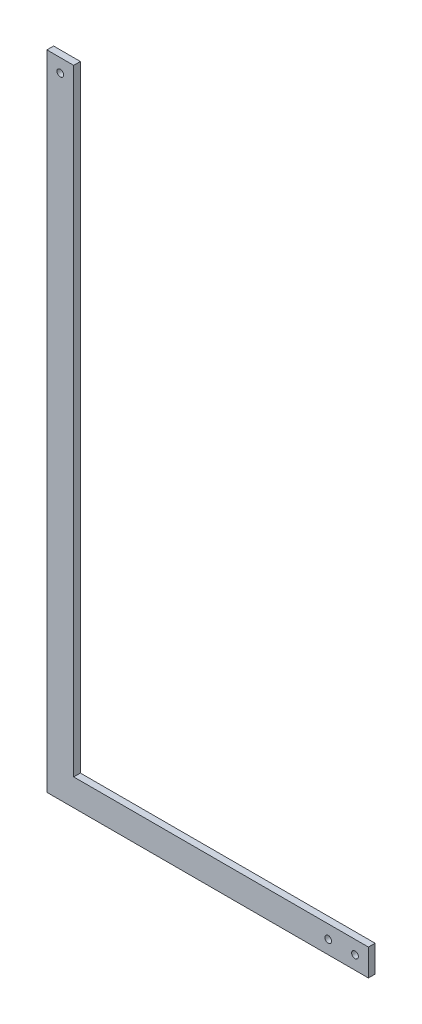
ISO-10303-21;
HEADER;
FILE_DESCRIPTION(('STEP AP214'),'2;1');
FILE_NAME('part.step','',(''),(''),'','','');
FILE_SCHEMA(('AUTOMOTIVE_DESIGN { 1 0 10303 214 1 1 1 1 }'));
ENDSEC;
DATA;
#1=APPLICATION_CONTEXT('core data for automotive mechanical design processes');
#2=APPLICATION_PROTOCOL_DEFINITION('international standard','automotive_design',2000,#1);
#3=PRODUCT_CONTEXT('',#1,'mechanical');
#4=PRODUCT('Part','Part','',(#3));
#5=PRODUCT_RELATED_PRODUCT_CATEGORY('part','',(#4));
#6=PRODUCT_DEFINITION_FORMATION('','',#4);
#7=PRODUCT_DEFINITION_CONTEXT('part definition',#1,'design');
#8=PRODUCT_DEFINITION('design','',#6,#7);
#9=PRODUCT_DEFINITION_SHAPE('','',#8);
#10=(LENGTH_UNIT() NAMED_UNIT(*) SI_UNIT(.MILLI.,.METRE.));
#11=(NAMED_UNIT(*) PLANE_ANGLE_UNIT() SI_UNIT($,.RADIAN.));
#12=(NAMED_UNIT(*) SI_UNIT($,.STERADIAN.) SOLID_ANGLE_UNIT());
#13=UNCERTAINTY_MEASURE_WITH_UNIT(LENGTH_MEASURE(1.E-05),#10,'distance_accuracy_value','');
#14=(GEOMETRIC_REPRESENTATION_CONTEXT(3) GLOBAL_UNCERTAINTY_ASSIGNED_CONTEXT((#13)) GLOBAL_UNIT_ASSIGNED_CONTEXT((#10,
#11,#12)) REPRESENTATION_CONTEXT('',''));
#15=CARTESIAN_POINT('',(0.,0.,0.));
#16=DIRECTION('',(0.,0.,1.));
#17=DIRECTION('',(1.,0.,0.));
#18=AXIS2_PLACEMENT_3D('',#15,#16,#17);
#19=CARTESIAN_POINT('',(0.,0.,3.175));
#20=DIRECTION('',(0.,0.,1.));
#21=DIRECTION('',(1.,0.,0.));
#22=AXIS2_PLACEMENT_3D('',#19,#20,#21);
#23=PLANE('',#22);
#24=CARTESIAN_POINT('',(109.199180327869,-51.9450819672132,3.175));
#25=DIRECTION('',(0.,0.,1.));
#26=DIRECTION('',(1.,0.,0.));
#27=AXIS2_PLACEMENT_3D('',#24,#25,#26);
#28=CIRCLE('',#27,1.58750000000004);
#29=CARTESIAN_POINT('',(110.786680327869,-51.9450819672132,3.175));
#30=VERTEX_POINT('',#29);
#31=EDGE_CURVE('E207',#30,#30,#28,.T.);
#32=ORIENTED_EDGE('',*,*,#31,.F.);
#33=EDGE_LOOP('',(#32));
#34=FACE_BOUND('',#33,.T.);
#35=DIRECTION('',(-1.,0.,0.));
#36=VECTOR('',#35,1.);
#37=CARTESIAN_POINT('',(-11.4508196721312,246.504918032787,3.175));
#38=LINE('',#37,#36);
#39=CARTESIAN_POINT('',(-11.4508196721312,246.504918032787,3.175));
#40=VERTEX_POINT('',#39);
#41=CARTESIAN_POINT('',(-24.1508196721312,246.504918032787,3.175));
#42=VERTEX_POINT('',#41);
#43=EDGE_CURVE('E146',#40,#42,#38,.T.);
#44=ORIENTED_EDGE('',*,*,#43,.T.);
#45=DIRECTION('',(0.,-1.,0.));
#46=VECTOR('',#45,1.);
#47=CARTESIAN_POINT('',(-24.1508196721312,246.504918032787,3.175));
#48=LINE('',#47,#46);
#49=CARTESIAN_POINT('',(-24.1508196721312,-58.2950819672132,3.175));
#50=VERTEX_POINT('',#49);
#51=EDGE_CURVE('E94',#42,#50,#48,.T.);
#52=ORIENTED_EDGE('',*,*,#51,.T.);
#53=DIRECTION('',(1.,0.,0.));
#54=VECTOR('',#53,1.);
#55=CARTESIAN_POINT('',(-24.1508196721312,-58.2950819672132,3.175));
#56=LINE('',#55,#54);
#57=CARTESIAN_POINT('',(128.249180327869,-58.2950819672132,3.175));
#58=VERTEX_POINT('',#57);
#59=EDGE_CURVE('E107',#50,#58,#56,.T.);
#60=ORIENTED_EDGE('',*,*,#59,.T.);
#61=DIRECTION('',(0.,1.,0.));
#62=VECTOR('',#61,1.);
#63=CARTESIAN_POINT('',(128.249180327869,-58.2950819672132,3.175));
#64=LINE('',#63,#62);
#65=CARTESIAN_POINT('',(128.249180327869,-45.5950819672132,3.175));
#66=VERTEX_POINT('',#65);
#67=EDGE_CURVE('E101',#58,#66,#64,.T.);
#68=ORIENTED_EDGE('',*,*,#67,.T.);
#69=DIRECTION('',(-1.,0.,0.));
#70=VECTOR('',#69,1.);
#71=CARTESIAN_POINT('',(128.249180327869,-45.5950819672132,3.175));
#72=LINE('',#71,#70);
#73=CARTESIAN_POINT('',(-11.4508196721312,-45.5950819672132,3.175));
#74=VERTEX_POINT('',#73);
#75=EDGE_CURVE('E105',#66,#74,#72,.T.);
#76=ORIENTED_EDGE('',*,*,#75,.T.);
#77=DIRECTION('',(0.,1.,0.));
#78=VECTOR('',#77,1.);
#79=CARTESIAN_POINT('',(-11.4508196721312,-45.5950819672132,3.175));
#80=LINE('',#79,#78);
#81=EDGE_CURVE('E57',#74,#40,#80,.T.);
#82=ORIENTED_EDGE('',*,*,#81,.T.);
#83=EDGE_LOOP('',(#44,#52,#60,#68,#76,#82));
#84=FACE_BOUND('',#83,.T.);
#85=CARTESIAN_POINT('',(-17.8008196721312,240.154918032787,3.175));
#86=DIRECTION('',(0.,0.,1.));
#87=DIRECTION('',(1.,0.,0.));
#88=AXIS2_PLACEMENT_3D('',#85,#86,#87);
#89=CIRCLE('',#88,1.5875);
#90=CARTESIAN_POINT('',(-16.2133196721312,240.154918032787,3.175));
#91=VERTEX_POINT('',#90);
#92=EDGE_CURVE('E134',#91,#91,#89,.T.);
#93=ORIENTED_EDGE('',*,*,#92,.F.);
#94=EDGE_LOOP('',(#93));
#95=FACE_BOUND('',#94,.T.);
#96=CARTESIAN_POINT('',(121.899180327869,-51.9450819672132,3.175));
#97=DIRECTION('',(0.,0.,1.));
#98=DIRECTION('',(1.,0.,0.));
#99=AXIS2_PLACEMENT_3D('',#96,#97,#98);
#100=CIRCLE('',#99,1.58750000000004);
#101=CARTESIAN_POINT('',(123.486680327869,-51.9450819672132,3.175));
#102=VERTEX_POINT('',#101);
#103=EDGE_CURVE('E196',#102,#102,#100,.T.);
#104=ORIENTED_EDGE('',*,*,#103,.F.);
#105=EDGE_LOOP('',(#104));
#106=FACE_BOUND('',#105,.T.);
#107=ADVANCED_FACE('F39',(#34,#84,#95,#106),#23,.T.);
#108=CARTESIAN_POINT('',(0.,0.,0.));
#109=DIRECTION('',(0.,0.,1.));
#110=DIRECTION('',(1.,0.,0.));
#111=AXIS2_PLACEMENT_3D('',#108,#109,#110);
#112=PLANE('',#111);
#113=DIRECTION('',(-1.,0.,0.));
#114=VECTOR('',#113,1.);
#115=CARTESIAN_POINT('',(-11.4508196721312,246.504918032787,0.));
#116=LINE('',#115,#114);
#117=CARTESIAN_POINT('',(-11.4508196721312,246.504918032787,0.));
#118=VERTEX_POINT('',#117);
#119=CARTESIAN_POINT('',(-24.1508196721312,246.504918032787,0.));
#120=VERTEX_POINT('',#119);
#121=EDGE_CURVE('E129',#118,#120,#116,.T.);
#122=ORIENTED_EDGE('',*,*,#121,.F.);
#123=DIRECTION('',(0.,1.,0.));
#124=VECTOR('',#123,1.);
#125=CARTESIAN_POINT('',(-11.4508196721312,-45.5950819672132,0.));
#126=LINE('',#125,#124);
#127=CARTESIAN_POINT('',(-11.4508196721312,-45.5950819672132,0.));
#128=VERTEX_POINT('',#127);
#129=EDGE_CURVE('E86',#128,#118,#126,.T.);
#130=ORIENTED_EDGE('',*,*,#129,.F.);
#131=DIRECTION('',(-1.,0.,0.));
#132=VECTOR('',#131,1.);
#133=CARTESIAN_POINT('',(128.249180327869,-45.5950819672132,0.));
#134=LINE('',#133,#132);
#135=CARTESIAN_POINT('',(128.249180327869,-45.5950819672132,0.));
#136=VERTEX_POINT('',#135);
#137=EDGE_CURVE('E80',#136,#128,#134,.T.);
#138=ORIENTED_EDGE('',*,*,#137,.F.);
#139=DIRECTION('',(0.,1.,0.));
#140=VECTOR('',#139,1.);
#141=CARTESIAN_POINT('',(128.249180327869,-58.2950819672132,0.));
#142=LINE('',#141,#140);
#143=CARTESIAN_POINT('',(128.249180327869,-58.2950819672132,0.));
#144=VERTEX_POINT('',#143);
#145=EDGE_CURVE('E116',#144,#136,#142,.T.);
#146=ORIENTED_EDGE('',*,*,#145,.F.);
#147=DIRECTION('',(1.,0.,0.));
#148=VECTOR('',#147,1.);
#149=CARTESIAN_POINT('',(-24.1508196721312,-58.2950819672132,0.));
#150=LINE('',#149,#148);
#151=CARTESIAN_POINT('',(-24.1508196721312,-58.2950819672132,0.));
#152=VERTEX_POINT('',#151);
#153=EDGE_CURVE('E137',#152,#144,#150,.T.);
#154=ORIENTED_EDGE('',*,*,#153,.F.);
#155=DIRECTION('',(0.,-1.,0.));
#156=VECTOR('',#155,1.);
#157=CARTESIAN_POINT('',(-24.1508196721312,246.504918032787,0.));
#158=LINE('',#157,#156);
#159=EDGE_CURVE('E133',#120,#152,#158,.T.);
#160=ORIENTED_EDGE('',*,*,#159,.F.);
#161=EDGE_LOOP('',(#122,#130,#138,#146,#154,#160));
#162=FACE_BOUND('',#161,.T.);
#163=CARTESIAN_POINT('',(-17.8008196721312,240.154918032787,0.));
#164=DIRECTION('',(0.,0.,1.));
#165=DIRECTION('',(1.,0.,0.));
#166=AXIS2_PLACEMENT_3D('',#163,#164,#165);
#167=CIRCLE('',#166,1.5875);
#168=CARTESIAN_POINT('',(-16.2133196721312,240.154918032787,0.));
#169=VERTEX_POINT('',#168);
#170=EDGE_CURVE('E211',#169,#169,#167,.T.);
#171=ORIENTED_EDGE('',*,*,#170,.T.);
#172=EDGE_LOOP('',(#171));
#173=FACE_BOUND('',#172,.T.);
#174=CARTESIAN_POINT('',(109.199180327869,-51.9450819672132,0.));
#175=DIRECTION('',(0.,0.,1.));
#176=DIRECTION('',(1.,0.,0.));
#177=AXIS2_PLACEMENT_3D('',#174,#175,#176);
#178=CIRCLE('',#177,1.58750000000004);
#179=CARTESIAN_POINT('',(110.786680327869,-51.9450819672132,0.));
#180=VERTEX_POINT('',#179);
#181=EDGE_CURVE('E204',#180,#180,#178,.T.);
#182=ORIENTED_EDGE('',*,*,#181,.T.);
#183=EDGE_LOOP('',(#182));
#184=FACE_BOUND('',#183,.T.);
#185=CARTESIAN_POINT('',(121.899180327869,-51.9450819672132,0.));
#186=DIRECTION('',(0.,0.,1.));
#187=DIRECTION('',(1.,0.,0.));
#188=AXIS2_PLACEMENT_3D('',#185,#186,#187);
#189=CIRCLE('',#188,1.58750000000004);
#190=CARTESIAN_POINT('',(123.486680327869,-51.9450819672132,0.));
#191=VERTEX_POINT('',#190);
#192=EDGE_CURVE('E199',#191,#191,#189,.T.);
#193=ORIENTED_EDGE('',*,*,#192,.T.);
#194=EDGE_LOOP('',(#193));
#195=FACE_BOUND('',#194,.T.);
#196=ADVANCED_FACE('F159',(#162,#173,#184,#195),#112,.F.);
#197=CARTESIAN_POINT('',(-11.4508196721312,246.504918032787,3.175));
#198=DIRECTION('',(0.,-1.,0.));
#199=DIRECTION('',(0.,0.,-1.));
#200=AXIS2_PLACEMENT_3D('',#197,#198,#199);
#201=PLANE('',#200);
#202=ORIENTED_EDGE('',*,*,#121,.T.);
#203=DIRECTION('',(0.,0.,-1.));
#204=VECTOR('',#203,1.);
#205=CARTESIAN_POINT('',(-24.1508196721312,246.504918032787,3.175));
#206=LINE('',#205,#204);
#207=EDGE_CURVE('E11',#42,#120,#206,.T.);
#208=ORIENTED_EDGE('',*,*,#207,.F.);
#209=ORIENTED_EDGE('',*,*,#43,.F.);
#210=DIRECTION('',(0.,0.,-1.));
#211=VECTOR('',#210,1.);
#212=CARTESIAN_POINT('',(-11.4508196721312,246.504918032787,3.175));
#213=LINE('',#212,#211);
#214=EDGE_CURVE('E125',#40,#118,#213,.T.);
#215=ORIENTED_EDGE('',*,*,#214,.T.);
#216=EDGE_LOOP('',(#202,#208,#209,#215));
#217=FACE_BOUND('',#216,.T.);
#218=ADVANCED_FACE('F41',(#217),#201,.F.);
#219=CARTESIAN_POINT('',(-24.1508196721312,246.504918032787,3.175));
#220=DIRECTION('',(1.,0.,0.));
#221=DIRECTION('',(0.,1.,0.));
#222=AXIS2_PLACEMENT_3D('',#219,#220,#221);
#223=PLANE('',#222);
#224=ORIENTED_EDGE('',*,*,#159,.T.);
#225=DIRECTION('',(0.,0.,-1.));
#226=VECTOR('',#225,1.);
#227=CARTESIAN_POINT('',(-24.1508196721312,-58.2950819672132,3.175));
#228=LINE('',#227,#226);
#229=EDGE_CURVE('E49',#50,#152,#228,.T.);
#230=ORIENTED_EDGE('',*,*,#229,.F.);
#231=ORIENTED_EDGE('',*,*,#51,.F.);
#232=ORIENTED_EDGE('',*,*,#207,.T.);
#233=EDGE_LOOP('',(#224,#230,#231,#232));
#234=FACE_BOUND('',#233,.T.);
#235=ADVANCED_FACE('F267',(#234),#223,.F.);
#236=CARTESIAN_POINT('',(-24.1508196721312,-58.2950819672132,3.175));
#237=DIRECTION('',(0.,1.,0.));
#238=DIRECTION('',(-1.,0.,0.));
#239=AXIS2_PLACEMENT_3D('',#236,#237,#238);
#240=PLANE('',#239);
#241=ORIENTED_EDGE('',*,*,#153,.T.);
#242=DIRECTION('',(0.,0.,-1.));
#243=VECTOR('',#242,1.);
#244=CARTESIAN_POINT('',(128.249180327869,-58.2950819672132,3.175));
#245=LINE('',#244,#243);
#246=EDGE_CURVE('E118',#58,#144,#245,.T.);
#247=ORIENTED_EDGE('',*,*,#246,.F.);
#248=ORIENTED_EDGE('',*,*,#59,.F.);
#249=ORIENTED_EDGE('',*,*,#229,.T.);
#250=EDGE_LOOP('',(#241,#247,#248,#249));
#251=FACE_BOUND('',#250,.T.);
#252=ADVANCED_FACE('F156',(#251),#240,.F.);
#253=CARTESIAN_POINT('',(128.249180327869,-58.2950819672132,3.175));
#254=DIRECTION('',(-1.,0.,0.));
#255=DIRECTION('',(0.,0.,1.));
#256=AXIS2_PLACEMENT_3D('',#253,#254,#255);
#257=PLANE('',#256);
#258=ORIENTED_EDGE('',*,*,#145,.T.);
#259=DIRECTION('',(0.,0.,-1.));
#260=VECTOR('',#259,1.);
#261=CARTESIAN_POINT('',(128.249180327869,-45.5950819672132,3.175));
#262=LINE('',#261,#260);
#263=EDGE_CURVE('E113',#66,#136,#262,.T.);
#264=ORIENTED_EDGE('',*,*,#263,.F.);
#265=ORIENTED_EDGE('',*,*,#67,.F.);
#266=ORIENTED_EDGE('',*,*,#246,.T.);
#267=EDGE_LOOP('',(#258,#264,#265,#266));
#268=FACE_BOUND('',#267,.T.);
#269=ADVANCED_FACE('F114',(#268),#257,.F.);
#270=CARTESIAN_POINT('',(128.249180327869,-45.5950819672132,3.175));
#271=DIRECTION('',(0.,-1.,0.));
#272=DIRECTION('',(1.,0.,0.));
#273=AXIS2_PLACEMENT_3D('',#270,#271,#272);
#274=PLANE('',#273);
#275=ORIENTED_EDGE('',*,*,#137,.T.);
#276=DIRECTION('',(0.,0.,-1.));
#277=VECTOR('',#276,1.);
#278=CARTESIAN_POINT('',(-11.4508196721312,-45.5950819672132,3.175));
#279=LINE('',#278,#277);
#280=EDGE_CURVE('E119',#74,#128,#279,.T.);
#281=ORIENTED_EDGE('',*,*,#280,.F.);
#282=ORIENTED_EDGE('',*,*,#75,.F.);
#283=ORIENTED_EDGE('',*,*,#263,.T.);
#284=EDGE_LOOP('',(#275,#281,#282,#283));
#285=FACE_BOUND('',#284,.T.);
#286=ADVANCED_FACE('F121',(#285),#274,.F.);
#287=CARTESIAN_POINT('',(-11.4508196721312,-45.5950819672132,3.175));
#288=DIRECTION('',(-1.,0.,0.));
#289=DIRECTION('',(0.,-1.,0.));
#290=AXIS2_PLACEMENT_3D('',#287,#288,#289);
#291=PLANE('',#290);
#292=ORIENTED_EDGE('',*,*,#129,.T.);
#293=ORIENTED_EDGE('',*,*,#214,.F.);
#294=ORIENTED_EDGE('',*,*,#81,.F.);
#295=ORIENTED_EDGE('',*,*,#280,.T.);
#296=EDGE_LOOP('',(#292,#293,#294,#295));
#297=FACE_BOUND('',#296,.T.);
#298=ADVANCED_FACE('F164',(#297),#291,.F.);
#299=CARTESIAN_POINT('',(-17.8008196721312,240.154918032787,3.175));
#300=DIRECTION('',(0.,0.,-1.));
#301=DIRECTION('',(-1.,0.,0.));
#302=AXIS2_PLACEMENT_3D('',#299,#300,#301);
#303=CYLINDRICAL_SURFACE('',#302,1.5875);
#304=ORIENTED_EDGE('',*,*,#92,.T.);
#305=EDGE_LOOP('',(#304));
#306=FACE_BOUND('',#305,.T.);
#307=ORIENTED_EDGE('',*,*,#170,.F.);
#308=EDGE_LOOP('',(#307));
#309=FACE_BOUND('',#308,.T.);
#310=ADVANCED_FACE('F166',(#306,#309),#303,.F.);
#311=CARTESIAN_POINT('',(109.199180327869,-51.9450819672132,3.175));
#312=DIRECTION('',(0.,0.,-1.));
#313=DIRECTION('',(-1.,0.,0.));
#314=AXIS2_PLACEMENT_3D('',#311,#312,#313);
#315=CYLINDRICAL_SURFACE('',#314,1.58750000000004);
#316=ORIENTED_EDGE('',*,*,#31,.T.);
#317=EDGE_LOOP('',(#316));
#318=FACE_BOUND('',#317,.T.);
#319=ORIENTED_EDGE('',*,*,#181,.F.);
#320=EDGE_LOOP('',(#319));
#321=FACE_BOUND('',#320,.T.);
#322=ADVANCED_FACE('F172',(#318,#321),#315,.F.);
#323=CARTESIAN_POINT('',(121.899180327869,-51.9450819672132,3.175));
#324=DIRECTION('',(0.,0.,-1.));
#325=DIRECTION('',(-1.,0.,0.));
#326=AXIS2_PLACEMENT_3D('',#323,#324,#325);
#327=CYLINDRICAL_SURFACE('',#326,1.58750000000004);
#328=ORIENTED_EDGE('',*,*,#103,.T.);
#329=EDGE_LOOP('',(#328));
#330=FACE_BOUND('',#329,.T.);
#331=ORIENTED_EDGE('',*,*,#192,.F.);
#332=EDGE_LOOP('',(#331));
#333=FACE_BOUND('',#332,.T.);
#334=ADVANCED_FACE('F187',(#330,#333),#327,.F.);
#335=CLOSED_SHELL('',(#107,#196,#218,#235,#252,#269,#286,#298,#310,#322,#334));
#336=MANIFOLD_SOLID_BREP('B2',#335);
#337=ADVANCED_BREP_SHAPE_REPRESENTATION('',(#18,#336),#14);
#338=SHAPE_DEFINITION_REPRESENTATION(#9,#337);
ENDSEC;
END-ISO-10303-21;
